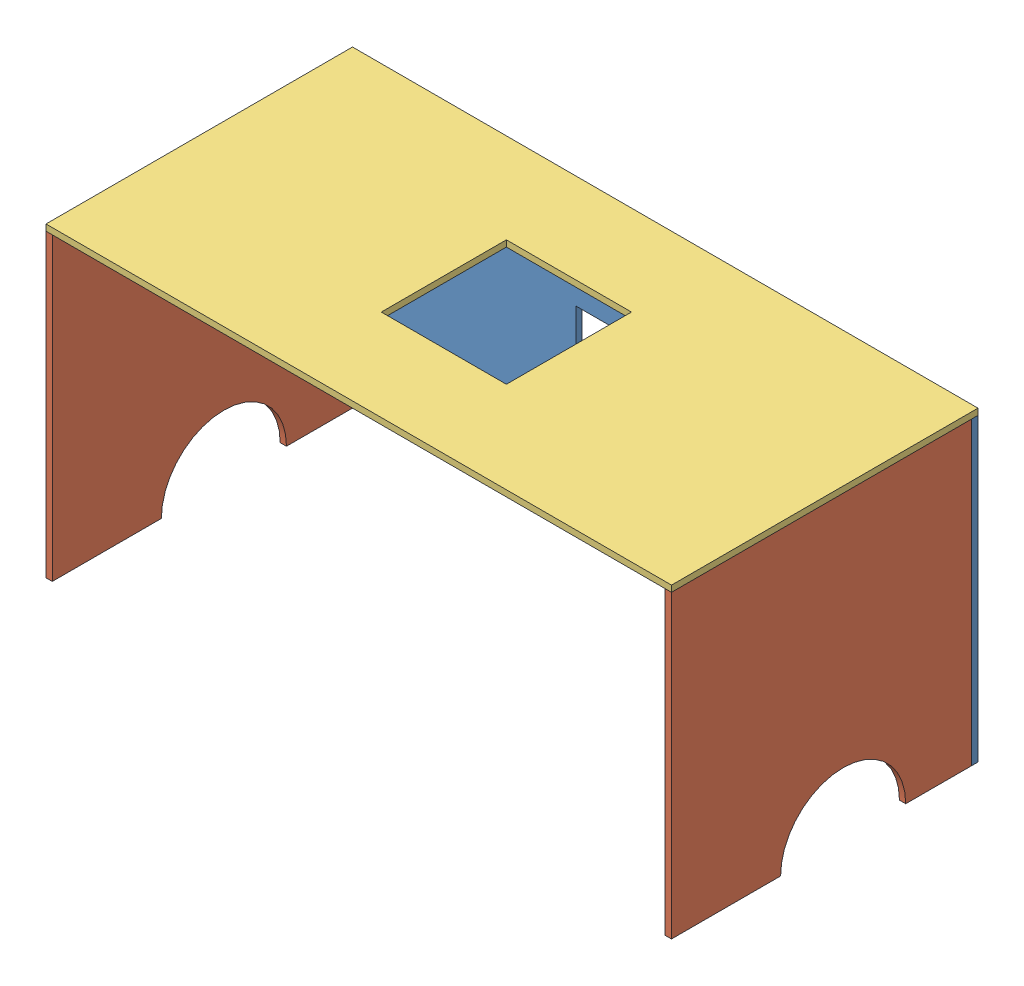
SolidWorks assembly Assembled Box.SLDASM, configuration Default (file format 4700). Lengths in mm.
Overall size (635 311.15 311.15).
4 component instances, 3 part files, 6 mates.
Components (placement in the parent):
- back wall-1: back wall.SLDPRT [Default] at (-390.2592 -152.41 309.4796) size (635 304.8 6.35)
- side wall-1: side wall.SLDPRT [Default] at (208.9991 -29.6213 609.6755) x (0 0 1) z (0 -1 0) size (304.8 6.35 304.8)
- top wall-1: top wall.SLDPRT [Default] at (-385.4356 247.9719 256.4702) x (1 0 0) z (0 1 0) size (635 311.15 6.35)
- side wall-2: side wall.SLDPRT [Default] at (-419.6509 -29.6213 609.6755) x (0 0 1) z (0 -1 0) size (304.8 6.35 304.8)
Mates (geometry in assembly coordinates):
- Coincident9: coincident anti-aligned: line of side wall-1 through (208.9991 247.9719 315.8296) axis (0 0 1); line of top wall-1 through (208.9991 247.9719 620.6296) axis (0 0 -1)
- Coincident10: coincident aligned: line of top wall-1 through (-426.0009 247.9719 309.4796) axis (0 0 1); line of side wall-2 through (-426.0009 247.9719 315.8296) axis (0 0 1)
- Coincident11: coincident aligned: line of top wall-1 through (-426.0009 247.9719 620.6296) axis (1 0 0); line of side wall-2 through (-426.0009 247.9719 620.6296) axis (1 0 0)
- Coincident12: coincident aligned: line of side wall-1 through (202.6491 247.9719 620.6296) axis (1 0 0); line of top wall-1 through (-426.0009 247.9719 620.6296) axis (1 0 0)
- Coincident13: coincident aligned: line of back wall-1 through (208.9991 247.9719 309.4796) axis (-1 0 0); line of top wall-1 through (208.9991 247.9719 309.4796) axis (-1 0 0)
- Coincident14: coincident anti-aligned: line of back wall-1 through (-426.0009 247.9719 315.8296) axis (0 -1 0); line of side wall-2 through (-426.0009 -56.8281 315.8296) axis (0 1 0)
